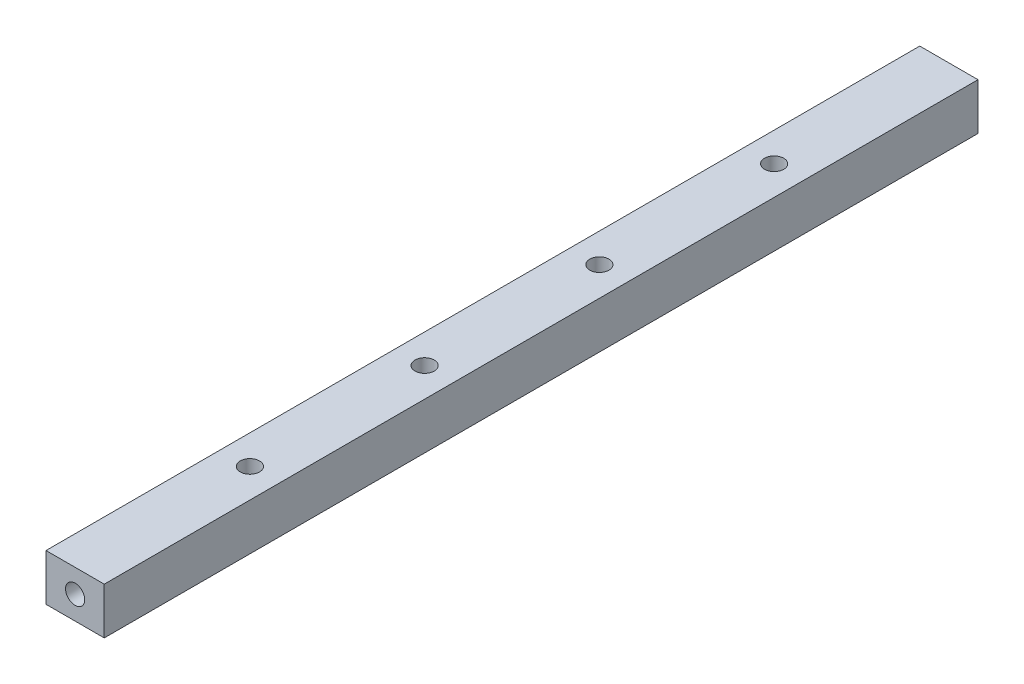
from build123d import *

# Parameters (mm, degrees)
ESQUISSE1_W                = 10
ESQUISSE1_H                = 8
BOSS_EXTRU_1_DEPTH         = 150
TROU_TARAUD_M41_D          = 3.3
TROU_TARAUD_M41_DEPTH      = 20
TROU_TARAUD_M41_TIP        = 0.991420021
TROU_TARAUD_M42_D          = 3.3
R_P_TITION_LIN_AIRE1_COUNT = 4
R_P_TITION_LIN_AIRE1_PITCH = 30


with BuildPart() as part:
    # Esquisse1 → Boss.-Extru.1 (new body)
    with BuildSketch(Plane.XY):
        Rectangle(ESQUISSE1_W, ESQUISSE1_H)
    extrude(amount=BOSS_EXTRU_1_DEPTH)

    # Trou taraud_ M41
    with Locations(Plane.XY.offset(150)):
        with Locations((0, 0)):
            Hole(TROU_TARAUD_M41_D / 2, depth=TROU_TARAUD_M41_DEPTH)
            with Locations((0, 0, -(TROU_TARAUD_M41_DEPTH + TROU_TARAUD_M41_TIP / 2))):  # 118° drill point
                Cone(0, TROU_TARAUD_M41_D / 2, TROU_TARAUD_M41_TIP, mode=Mode.SUBTRACT)

    # Trou taraud_ M42 (through all)
    with Locations(Plane(origin=(0, 4, 0), x_dir=(-1, 0, 0), z_dir=(0, 1, 0))):
        with Locations((0, 30)):
            trou_taraud_m42 = Hole(TROU_TARAUD_M42_D / 2)

    # R_p_tition lin_aire1: Trou taraud_ M42 ×4
    with Locations(*[(0, 0, i * R_P_TITION_LIN_AIRE1_PITCH) for i in range(1, R_P_TITION_LIN_AIRE1_COUNT)]):
        add(trou_taraud_m42, mode=Mode.SUBTRACT)


solid = part.part
